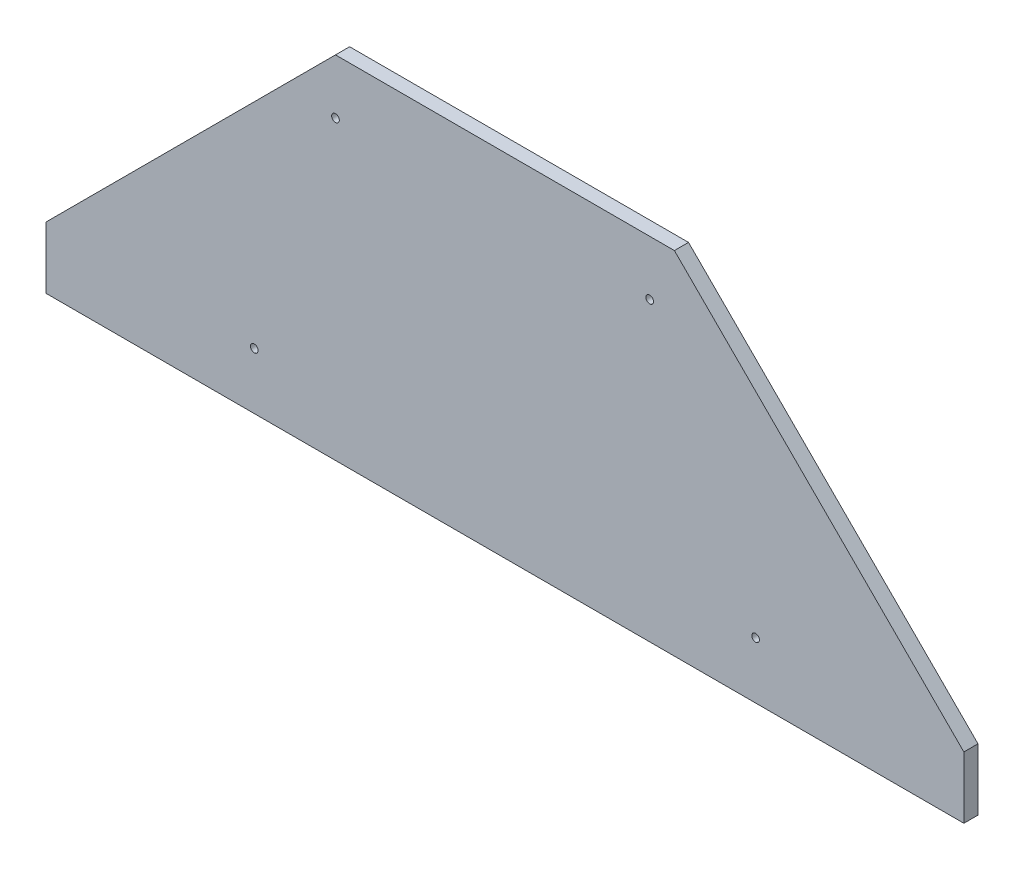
ISO-10303-21;
HEADER;
FILE_DESCRIPTION(('STEP AP214'),'2;1');
FILE_NAME('part.step','',(''),(''),'','','');
FILE_SCHEMA(('AUTOMOTIVE_DESIGN { 1 0 10303 214 1 1 1 1 }'));
ENDSEC;
DATA;
#1=APPLICATION_CONTEXT('core data for automotive mechanical design processes');
#2=APPLICATION_PROTOCOL_DEFINITION('international standard','automotive_design',2000,#1);
#3=PRODUCT_CONTEXT('',#1,'mechanical');
#4=PRODUCT('Part','Part','',(#3));
#5=PRODUCT_RELATED_PRODUCT_CATEGORY('part','',(#4));
#6=PRODUCT_DEFINITION_FORMATION('','',#4);
#7=PRODUCT_DEFINITION_CONTEXT('part definition',#1,'design');
#8=PRODUCT_DEFINITION('design','',#6,#7);
#9=PRODUCT_DEFINITION_SHAPE('','',#8);
#10=(LENGTH_UNIT() NAMED_UNIT(*) SI_UNIT(.MILLI.,.METRE.));
#11=(NAMED_UNIT(*) PLANE_ANGLE_UNIT() SI_UNIT($,.RADIAN.));
#12=(NAMED_UNIT(*) SI_UNIT($,.STERADIAN.) SOLID_ANGLE_UNIT());
#13=UNCERTAINTY_MEASURE_WITH_UNIT(LENGTH_MEASURE(1.E-05),#10,'distance_accuracy_value','');
#14=(GEOMETRIC_REPRESENTATION_CONTEXT(3) GLOBAL_UNCERTAINTY_ASSIGNED_CONTEXT((#13)) GLOBAL_UNIT_ASSIGNED_CONTEXT((#10,
#11,#12)) REPRESENTATION_CONTEXT('',''));
#15=CARTESIAN_POINT('',(0.,0.,0.));
#16=DIRECTION('',(0.,0.,1.));
#17=DIRECTION('',(1.,0.,0.));
#18=AXIS2_PLACEMENT_3D('',#15,#16,#17);
#19=CARTESIAN_POINT('',(0.,157.95625,6.35));
#20=DIRECTION('',(0.,1.,0.));
#21=DIRECTION('',(0.,0.,1.));
#22=AXIS2_PLACEMENT_3D('',#19,#20,#21);
#23=PLANE('',#22);
#24=DIRECTION('',(1.,0.,0.));
#25=VECTOR('',#24,1.);
#26=CARTESIAN_POINT('',(0.,157.95625,-6.35));
#27=LINE('',#26,#25);
#28=CARTESIAN_POINT('',(-152.4,157.95625,-6.35));
#29=VERTEX_POINT('',#28);
#30=CARTESIAN_POINT('',(152.4,157.95625,-6.35));
#31=VERTEX_POINT('',#30);
#32=EDGE_CURVE('E126',#29,#31,#27,.T.);
#33=ORIENTED_EDGE('',*,*,#32,.F.);
#34=DIRECTION('',(0.,0.,-1.));
#35=VECTOR('',#34,1.);
#36=CARTESIAN_POINT('',(-152.4,157.95625,6.35));
#37=LINE('',#36,#35);
#38=CARTESIAN_POINT('',(-152.4,157.95625,6.35));
#39=VERTEX_POINT('',#38);
#40=EDGE_CURVE('E11',#39,#29,#37,.T.);
#41=ORIENTED_EDGE('',*,*,#40,.F.);
#42=DIRECTION('',(1.,0.,0.));
#43=VECTOR('',#42,1.);
#44=CARTESIAN_POINT('',(0.,157.95625,6.35));
#45=LINE('',#44,#43);
#46=CARTESIAN_POINT('',(152.4,157.95625,6.35));
#47=VERTEX_POINT('',#46);
#48=EDGE_CURVE('E280',#39,#47,#45,.T.);
#49=ORIENTED_EDGE('',*,*,#48,.T.);
#50=DIRECTION('',(0.,0.,-1.));
#51=VECTOR('',#50,1.);
#52=CARTESIAN_POINT('',(152.4,157.95625,6.35));
#53=LINE('',#52,#51);
#54=EDGE_CURVE('E49',#47,#31,#53,.T.);
#55=ORIENTED_EDGE('',*,*,#54,.T.);
#56=EDGE_LOOP('',(#33,#41,#49,#55));
#57=FACE_BOUND('',#56,.T.);
#58=ADVANCED_FACE('F32',(#57),#23,.T.);
#59=CARTESIAN_POINT('',(-498.999046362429,-188.642796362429,6.35));
#60=DIRECTION('',(0.707106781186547,-0.707106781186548,0.));
#61=DIRECTION('',(0.707106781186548,0.707106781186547,0.));
#62=AXIS2_PLACEMENT_3D('',#59,#60,#61);
#63=PLANE('',#62);
#64=DIRECTION('',(-0.707106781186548,-0.707106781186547,0.));
#65=VECTOR('',#64,1.);
#66=CARTESIAN_POINT('',(-498.999046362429,-188.642796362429,-6.35));
#67=LINE('',#66,#65);
#68=CARTESIAN_POINT('',(-412.75,-102.39375,-6.35));
#69=VERTEX_POINT('',#68);
#70=EDGE_CURVE('E123',#29,#69,#67,.T.);
#71=ORIENTED_EDGE('',*,*,#70,.T.);
#72=DIRECTION('',(0.,0.,-1.));
#73=VECTOR('',#72,1.);
#74=CARTESIAN_POINT('',(-412.75,-102.39375,6.35));
#75=LINE('',#74,#73);
#76=CARTESIAN_POINT('',(-412.75,-102.39375,6.35));
#77=VERTEX_POINT('',#76);
#78=EDGE_CURVE('E41',#77,#69,#75,.T.);
#79=ORIENTED_EDGE('',*,*,#78,.F.);
#80=DIRECTION('',(-0.707106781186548,-0.707106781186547,0.));
#81=VECTOR('',#80,1.);
#82=CARTESIAN_POINT('',(-498.999046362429,-188.642796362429,6.35));
#83=LINE('',#82,#81);
#84=EDGE_CURVE('E282',#39,#77,#83,.T.);
#85=ORIENTED_EDGE('',*,*,#84,.F.);
#86=ORIENTED_EDGE('',*,*,#40,.T.);
#87=EDGE_LOOP('',(#71,#79,#85,#86));
#88=FACE_BOUND('',#87,.T.);
#89=ADVANCED_FACE('F124',(#88),#63,.F.);
#90=CARTESIAN_POINT('',(-412.75,-687.641842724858,6.35));
#91=DIRECTION('',(-1.,0.,0.));
#92=DIRECTION('',(0.,0.,1.));
#93=AXIS2_PLACEMENT_3D('',#90,#91,#92);
#94=PLANE('',#93);
#95=DIRECTION('',(0.,1.,0.));
#96=VECTOR('',#95,1.);
#97=CARTESIAN_POINT('',(-412.75,-687.641842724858,-6.35));
#98=LINE('',#97,#96);
#99=CARTESIAN_POINT('',(-412.75,-157.95625,-6.35));
#100=VERTEX_POINT('',#99);
#101=EDGE_CURVE('E120',#100,#69,#98,.T.);
#102=ORIENTED_EDGE('',*,*,#101,.F.);
#103=DIRECTION('',(0.,0.,-1.));
#104=VECTOR('',#103,1.);
#105=CARTESIAN_POINT('',(-412.75,-157.95625,6.35));
#106=LINE('',#105,#104);
#107=CARTESIAN_POINT('',(-412.75,-157.95625,6.35));
#108=VERTEX_POINT('',#107);
#109=EDGE_CURVE('E109',#108,#100,#106,.T.);
#110=ORIENTED_EDGE('',*,*,#109,.F.);
#111=DIRECTION('',(0.,1.,0.));
#112=VECTOR('',#111,1.);
#113=CARTESIAN_POINT('',(-412.75,-687.641842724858,6.35));
#114=LINE('',#113,#112);
#115=EDGE_CURVE('E103',#108,#77,#114,.T.);
#116=ORIENTED_EDGE('',*,*,#115,.T.);
#117=ORIENTED_EDGE('',*,*,#78,.T.);
#118=EDGE_LOOP('',(#102,#110,#116,#117));
#119=FACE_BOUND('',#118,.T.);
#120=ADVANCED_FACE('F118',(#119),#94,.T.);
#121=CARTESIAN_POINT('',(0.,-157.95625,6.35));
#122=DIRECTION('',(0.,1.,0.));
#123=DIRECTION('',(0.,0.,1.));
#124=AXIS2_PLACEMENT_3D('',#121,#122,#123);
#125=PLANE('',#124);
#126=DIRECTION('',(1.,0.,0.));
#127=VECTOR('',#126,1.);
#128=CARTESIAN_POINT('',(0.,-157.95625,-6.35));
#129=LINE('',#128,#127);
#130=CARTESIAN_POINT('',(412.75,-157.95625,-6.35));
#131=VERTEX_POINT('',#130);
#132=EDGE_CURVE('E108',#100,#131,#129,.T.);
#133=ORIENTED_EDGE('',*,*,#132,.T.);
#134=DIRECTION('',(0.,0.,-1.));
#135=VECTOR('',#134,1.);
#136=CARTESIAN_POINT('',(412.75,-157.95625,6.35));
#137=LINE('',#136,#135);
#138=CARTESIAN_POINT('',(412.75,-157.95625,6.35));
#139=VERTEX_POINT('',#138);
#140=EDGE_CURVE('E91',#139,#131,#137,.T.);
#141=ORIENTED_EDGE('',*,*,#140,.F.);
#142=DIRECTION('',(1.,0.,0.));
#143=VECTOR('',#142,1.);
#144=CARTESIAN_POINT('',(0.,-157.95625,6.35));
#145=LINE('',#144,#143);
#146=EDGE_CURVE('E96',#108,#139,#145,.T.);
#147=ORIENTED_EDGE('',*,*,#146,.F.);
#148=ORIENTED_EDGE('',*,*,#109,.T.);
#149=EDGE_LOOP('',(#133,#141,#147,#148));
#150=FACE_BOUND('',#149,.T.);
#151=ADVANCED_FACE('F106',(#150),#125,.F.);
#152=CARTESIAN_POINT('',(412.75,-687.641842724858,6.35));
#153=DIRECTION('',(-1.,0.,0.));
#154=DIRECTION('',(0.,0.,1.));
#155=AXIS2_PLACEMENT_3D('',#152,#153,#154);
#156=PLANE('',#155);
#157=DIRECTION('',(0.,1.,0.));
#158=VECTOR('',#157,1.);
#159=CARTESIAN_POINT('',(412.75,-687.641842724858,-6.35));
#160=LINE('',#159,#158);
#161=CARTESIAN_POINT('',(412.75,-102.39375,-6.35));
#162=VERTEX_POINT('',#161);
#163=EDGE_CURVE('E130',#131,#162,#160,.T.);
#164=ORIENTED_EDGE('',*,*,#163,.T.);
#165=DIRECTION('',(0.,0.,-1.));
#166=VECTOR('',#165,1.);
#167=CARTESIAN_POINT('',(412.75,-102.39375,6.35));
#168=LINE('',#167,#166);
#169=CARTESIAN_POINT('',(412.75,-102.39375,6.35));
#170=VERTEX_POINT('',#169);
#171=EDGE_CURVE('E69',#170,#162,#168,.T.);
#172=ORIENTED_EDGE('',*,*,#171,.F.);
#173=DIRECTION('',(0.,1.,0.));
#174=VECTOR('',#173,1.);
#175=CARTESIAN_POINT('',(412.75,-687.641842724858,6.35));
#176=LINE('',#175,#174);
#177=EDGE_CURVE('E87',#139,#170,#176,.T.);
#178=ORIENTED_EDGE('',*,*,#177,.F.);
#179=ORIENTED_EDGE('',*,*,#140,.T.);
#180=EDGE_LOOP('',(#164,#172,#178,#179));
#181=FACE_BOUND('',#180,.T.);
#182=ADVANCED_FACE('F89',(#181),#156,.F.);
#183=CARTESIAN_POINT('',(130.175,108.74375,6.35));
#184=DIRECTION('',(0.,0.,-1.));
#185=DIRECTION('',(-1.,0.,0.));
#186=AXIS2_PLACEMENT_3D('',#183,#184,#185);
#187=CYLINDRICAL_SURFACE('',#186,3.429);
#188=CARTESIAN_POINT('',(130.175,108.74375,6.35));
#189=DIRECTION('',(0.,0.,1.));
#190=DIRECTION('',(1.,0.,0.));
#191=AXIS2_PLACEMENT_3D('',#188,#189,#190);
#192=CIRCLE('',#191,3.429);
#193=CARTESIAN_POINT('',(133.604,108.74375,6.35));
#194=VERTEX_POINT('',#193);
#195=EDGE_CURVE('E273',#194,#194,#192,.T.);
#196=ORIENTED_EDGE('',*,*,#195,.T.);
#197=EDGE_LOOP('',(#196));
#198=FACE_BOUND('',#197,.T.);
#199=CARTESIAN_POINT('',(130.175,108.74375,-6.35));
#200=DIRECTION('',(0.,0.,1.));
#201=DIRECTION('',(1.,0.,0.));
#202=AXIS2_PLACEMENT_3D('',#199,#200,#201);
#203=CIRCLE('',#202,3.429);
#204=CARTESIAN_POINT('',(133.604,108.74375,-6.35));
#205=VERTEX_POINT('',#204);
#206=EDGE_CURVE('E149',#205,#205,#203,.T.);
#207=ORIENTED_EDGE('',*,*,#206,.F.);
#208=EDGE_LOOP('',(#207));
#209=FACE_BOUND('',#208,.T.);
#210=ADVANCED_FACE('F172',(#198,#209),#187,.F.);
#211=CARTESIAN_POINT('',(-152.4,108.74375,6.35));
#212=DIRECTION('',(0.,0.,-1.));
#213=DIRECTION('',(-1.,0.,0.));
#214=AXIS2_PLACEMENT_3D('',#211,#212,#213);
#215=CYLINDRICAL_SURFACE('',#214,3.429);
#216=CARTESIAN_POINT('',(-152.4,108.74375,6.35));
#217=DIRECTION('',(0.,0.,1.));
#218=DIRECTION('',(1.,0.,0.));
#219=AXIS2_PLACEMENT_3D('',#216,#217,#218);
#220=CIRCLE('',#219,3.429);
#221=CARTESIAN_POINT('',(-148.971,108.74375,6.35));
#222=VERTEX_POINT('',#221);
#223=EDGE_CURVE('E270',#222,#222,#220,.T.);
#224=ORIENTED_EDGE('',*,*,#223,.T.);
#225=EDGE_LOOP('',(#224));
#226=FACE_BOUND('',#225,.T.);
#227=CARTESIAN_POINT('',(-152.4,108.74375,-6.35));
#228=DIRECTION('',(0.,0.,1.));
#229=DIRECTION('',(1.,0.,0.));
#230=AXIS2_PLACEMENT_3D('',#227,#228,#229);
#231=CIRCLE('',#230,3.429);
#232=CARTESIAN_POINT('',(-148.971,108.74375,-6.35));
#233=VERTEX_POINT('',#232);
#234=EDGE_CURVE('E146',#233,#233,#231,.T.);
#235=ORIENTED_EDGE('',*,*,#234,.F.);
#236=EDGE_LOOP('',(#235));
#237=FACE_BOUND('',#236,.T.);
#238=ADVANCED_FACE('F175',(#226,#237),#215,.F.);
#239=CARTESIAN_POINT('',(-225.425,-107.15625,6.35));
#240=DIRECTION('',(0.,0.,-1.));
#241=DIRECTION('',(-1.,0.,0.));
#242=AXIS2_PLACEMENT_3D('',#239,#240,#241);
#243=CYLINDRICAL_SURFACE('',#242,3.429);
#244=CARTESIAN_POINT('',(-225.425,-107.15625,6.35));
#245=DIRECTION('',(0.,0.,1.));
#246=DIRECTION('',(1.,0.,0.));
#247=AXIS2_PLACEMENT_3D('',#244,#245,#246);
#248=CIRCLE('',#247,3.429);
#249=CARTESIAN_POINT('',(-221.996,-107.15625,6.35));
#250=VERTEX_POINT('',#249);
#251=EDGE_CURVE('E186',#250,#250,#248,.T.);
#252=ORIENTED_EDGE('',*,*,#251,.T.);
#253=EDGE_LOOP('',(#252));
#254=FACE_BOUND('',#253,.T.);
#255=CARTESIAN_POINT('',(-225.425,-107.15625,-6.35));
#256=DIRECTION('',(0.,0.,1.));
#257=DIRECTION('',(1.,0.,0.));
#258=AXIS2_PLACEMENT_3D('',#255,#256,#257);
#259=CIRCLE('',#258,3.429);
#260=CARTESIAN_POINT('',(-221.996,-107.15625,-6.35));
#261=VERTEX_POINT('',#260);
#262=EDGE_CURVE('E143',#261,#261,#259,.T.);
#263=ORIENTED_EDGE('',*,*,#262,.F.);
#264=EDGE_LOOP('',(#263));
#265=FACE_BOUND('',#264,.T.);
#266=ADVANCED_FACE('F160',(#254,#265),#243,.F.);
#267=CARTESIAN_POINT('',(225.425,-107.15625,6.35));
#268=DIRECTION('',(0.,0.,-1.));
#269=DIRECTION('',(-1.,0.,0.));
#270=AXIS2_PLACEMENT_3D('',#267,#268,#269);
#271=CYLINDRICAL_SURFACE('',#270,3.429);
#272=CARTESIAN_POINT('',(225.425,-107.15625,6.35));
#273=DIRECTION('',(0.,0.,1.));
#274=DIRECTION('',(1.,0.,0.));
#275=AXIS2_PLACEMENT_3D('',#272,#273,#274);
#276=CIRCLE('',#275,3.429);
#277=CARTESIAN_POINT('',(228.854,-107.15625,6.35));
#278=VERTEX_POINT('',#277);
#279=EDGE_CURVE('E137',#278,#278,#276,.T.);
#280=ORIENTED_EDGE('',*,*,#279,.T.);
#281=EDGE_LOOP('',(#280));
#282=FACE_BOUND('',#281,.T.);
#283=CARTESIAN_POINT('',(225.425,-107.15625,-6.35));
#284=DIRECTION('',(0.,0.,1.));
#285=DIRECTION('',(1.,0.,0.));
#286=AXIS2_PLACEMENT_3D('',#283,#284,#285);
#287=CIRCLE('',#286,3.429);
#288=CARTESIAN_POINT('',(228.854,-107.15625,-6.35));
#289=VERTEX_POINT('',#288);
#290=EDGE_CURVE('E140',#289,#289,#287,.T.);
#291=ORIENTED_EDGE('',*,*,#290,.F.);
#292=EDGE_LOOP('',(#291));
#293=FACE_BOUND('',#292,.T.);
#294=ADVANCED_FACE('F34',(#282,#293),#271,.F.);
#295=CARTESIAN_POINT('',(498.999046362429,-188.642796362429,6.35));
#296=DIRECTION('',(0.707106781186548,0.707106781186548,0.));
#297=DIRECTION('',(-0.707106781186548,0.707106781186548,0.));
#298=AXIS2_PLACEMENT_3D('',#295,#296,#297);
#299=PLANE('',#298);
#300=DIRECTION('',(0.707106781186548,-0.707106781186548,0.));
#301=VECTOR('',#300,1.);
#302=CARTESIAN_POINT('',(498.999046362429,-188.642796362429,-6.35));
#303=LINE('',#302,#301);
#304=EDGE_CURVE('E135',#31,#162,#303,.T.);
#305=ORIENTED_EDGE('',*,*,#304,.F.);
#306=ORIENTED_EDGE('',*,*,#54,.F.);
#307=DIRECTION('',(0.707106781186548,-0.707106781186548,0.));
#308=VECTOR('',#307,1.);
#309=CARTESIAN_POINT('',(498.999046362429,-188.642796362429,6.35));
#310=LINE('',#309,#308);
#311=EDGE_CURVE('E95',#47,#170,#310,.T.);
#312=ORIENTED_EDGE('',*,*,#311,.T.);
#313=ORIENTED_EDGE('',*,*,#171,.T.);
#314=EDGE_LOOP('',(#305,#306,#312,#313));
#315=FACE_BOUND('',#314,.T.);
#316=ADVANCED_FACE('F151',(#315),#299,.T.);
#317=CARTESIAN_POINT('',(0.,-687.641842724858,6.35));
#318=DIRECTION('',(0.,0.,1.));
#319=DIRECTION('',(1.,0.,0.));
#320=AXIS2_PLACEMENT_3D('',#317,#318,#319);
#321=PLANE('',#320);
#322=ORIENTED_EDGE('',*,*,#279,.F.);
#323=EDGE_LOOP('',(#322));
#324=FACE_BOUND('',#323,.T.);
#325=ORIENTED_EDGE('',*,*,#251,.F.);
#326=EDGE_LOOP('',(#325));
#327=FACE_BOUND('',#326,.T.);
#328=ORIENTED_EDGE('',*,*,#223,.F.);
#329=EDGE_LOOP('',(#328));
#330=FACE_BOUND('',#329,.T.);
#331=ORIENTED_EDGE('',*,*,#195,.F.);
#332=EDGE_LOOP('',(#331));
#333=FACE_BOUND('',#332,.T.);
#334=ORIENTED_EDGE('',*,*,#48,.F.);
#335=ORIENTED_EDGE('',*,*,#84,.T.);
#336=ORIENTED_EDGE('',*,*,#115,.F.);
#337=ORIENTED_EDGE('',*,*,#146,.T.);
#338=ORIENTED_EDGE('',*,*,#177,.T.);
#339=ORIENTED_EDGE('',*,*,#311,.F.);
#340=EDGE_LOOP('',(#334,#335,#336,#337,#338,#339));
#341=FACE_BOUND('',#340,.T.);
#342=ADVANCED_FACE('F101',(#324,#327,#330,#333,#341),#321,.T.);
#343=CARTESIAN_POINT('',(0.,-687.641842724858,-6.35));
#344=DIRECTION('',(0.,0.,1.));
#345=DIRECTION('',(1.,0.,0.));
#346=AXIS2_PLACEMENT_3D('',#343,#344,#345);
#347=PLANE('',#346);
#348=ORIENTED_EDGE('',*,*,#290,.T.);
#349=EDGE_LOOP('',(#348));
#350=FACE_BOUND('',#349,.T.);
#351=ORIENTED_EDGE('',*,*,#262,.T.);
#352=EDGE_LOOP('',(#351));
#353=FACE_BOUND('',#352,.T.);
#354=ORIENTED_EDGE('',*,*,#234,.T.);
#355=EDGE_LOOP('',(#354));
#356=FACE_BOUND('',#355,.T.);
#357=ORIENTED_EDGE('',*,*,#206,.T.);
#358=EDGE_LOOP('',(#357));
#359=FACE_BOUND('',#358,.T.);
#360=ORIENTED_EDGE('',*,*,#32,.T.);
#361=ORIENTED_EDGE('',*,*,#304,.T.);
#362=ORIENTED_EDGE('',*,*,#163,.F.);
#363=ORIENTED_EDGE('',*,*,#132,.F.);
#364=ORIENTED_EDGE('',*,*,#101,.T.);
#365=ORIENTED_EDGE('',*,*,#70,.F.);
#366=EDGE_LOOP('',(#360,#361,#362,#363,#364,#365));
#367=FACE_BOUND('',#366,.T.);
#368=ADVANCED_FACE('F128',(#350,#353,#356,#359,#367),#347,.F.);
#369=CLOSED_SHELL('',(#58,#89,#120,#151,#182,#210,#238,#266,#294,#316,#342,#368));
#370=MANIFOLD_SOLID_BREP('B2',#369);
#371=ADVANCED_BREP_SHAPE_REPRESENTATION('',(#18,#370),#14);
#372=SHAPE_DEFINITION_REPRESENTATION(#9,#371);
ENDSEC;
END-ISO-10303-21;
